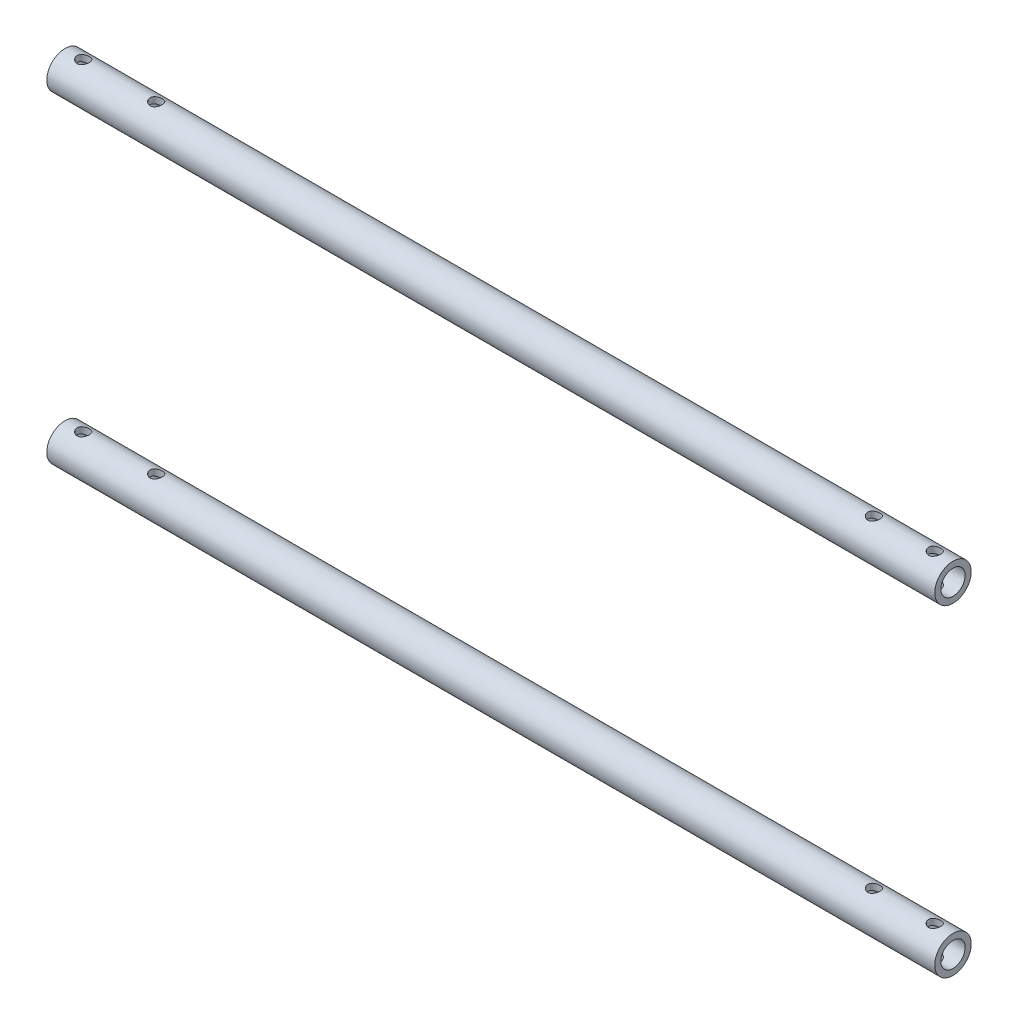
from build123d import *

# Parameters (mm, degrees)
SKETCH2_W          = 463.55
SKETCH2_H          = 3.175
SKETCH3_W          = 463.55
SKETCH3_H          = 3.175
SKETCH6_R          = 3.175
CUT_EXTRUDE2_DEPTH = 101.6


with BuildPart() as part:
    # Sketch2 → Revolve-Thin1 (revolve)
    with BuildSketch(Plane.XY, mode=Mode.PRIVATE) as revolve_thin1_sk:
        with Locations((231.775, 92.075)):
            Rectangle(SKETCH2_W, SKETCH2_H)
    revolve(revolve_thin1_sk.sketch.rotate(Axis((0, 84.1375, 0), (1, 0, 0)), 180), axis=Axis((0, 84.1375, 0), (1, 0, 0)))


with BuildPart() as body_2:
    # Sketch3 → Revolve-Thin2 (revolve)
    with BuildSketch(Plane.XY):
        with Locations((231.775, -92.075)):
            Rectangle(SKETCH3_W, SKETCH3_H)
    revolve(axis=Axis((0, -84.1375, 0), (1, 0, 0)))


with BuildPart() as cut_extrude2_tool:
    # Sketch6 → Cut-Extrude2 (new, symmetric)
    with BuildSketch(Plane(origin=(0, 0, 0), x_dir=(1, 0, 0), z_dir=(0, 1, 0))):
        with Locations(Location((9.525, 0, 0), (0, 0, 270))):
            Circle(SKETCH6_R)
        with Locations(Location((47.625, 0, 0), (0, 0, 270))):
            Circle(SKETCH6_R)
        with Locations(Location((422.275, 0, 0), (0, 0, 270))):
            Circle(SKETCH6_R)
        with Locations(Location((454.025, 0, 0), (0, 0, 270))):
            Circle(SKETCH6_R)
    extrude(amount=CUT_EXTRUDE2_DEPTH, both=True)


with BuildPart() as part_1:
    add(part.part)

    # Cut-Extrude2: cut by cut_extrude2_tool
    add(cut_extrude2_tool.part, mode=Mode.SUBTRACT)


with BuildPart() as body_2_1:
    add(body_2.part)

    # Cut-Extrude2: cut by cut_extrude2_tool
    add(cut_extrude2_tool.part, mode=Mode.SUBTRACT)


solid = Compound([part_1.part, body_2_1.part])
